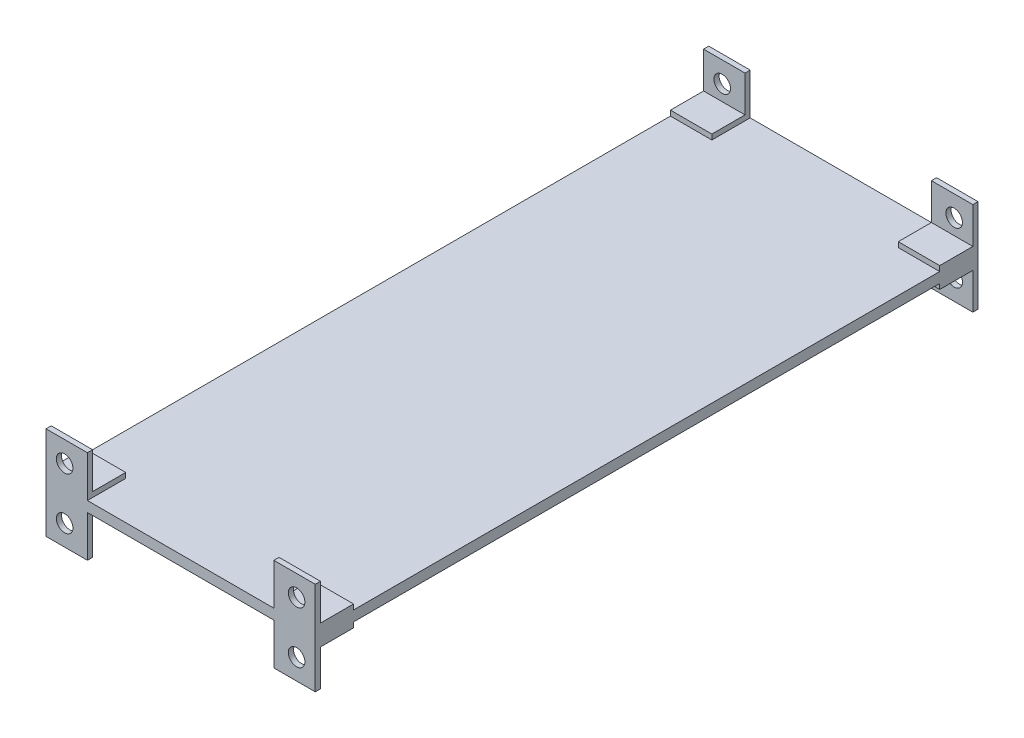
from build123d import *

# Parameters (mm, degrees)
EXTRUDE1_DEPTH      = 0.79375
EXTRUDE1_DEPTH_BACK = 0.79375
SKETCH4_W           = 41.275
SKETCH4_H           = 101.6
EXTRUDE2_DEPTH      = 6.35
EXTRUDE2_DEPTH_BACK = 7.9375
SKETCH5_W           = 6.35
SKETCH5_H           = 0.79375
EXTRUDE3_DEPTH      = 0.79375
EXTRUDE3_DEPTH_BACK = 2.38125
SKETCH6_W           = 6.35
SKETCH6_H           = 5.08
SKETCH7_R           = 1.27
CUT_EXTRUDE1_DEPTH  = 104.920640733


with BuildPart() as part:
    # Sketch4 → Extrude1 (new, two sides: drawn at the far end of the back side and taken through both)
    with BuildSketch(Plane(origin=(0, 0, 0), x_dir=(1, 0, 0), z_dir=(0, 1, 0)).offset(-EXTRUDE1_DEPTH_BACK)):
        with Locations((0, 50.8)):
            Rectangle(SKETCH4_W, SKETCH4_H)
    extrude(amount=EXTRUDE1_DEPTH + EXTRUDE1_DEPTH_BACK)

    # Sketch5 → Extrude2 (add, two sides: drawn at the far end of the back side and taken through both)
    with BuildSketch(Plane(origin=(0, 0.79375, 0), x_dir=(-1, 0, 0), z_dir=(0, 1, 0)).offset(-EXTRUDE2_DEPTH_BACK)):
        with Locations((-17.4625, -0.396875)):
            Rectangle(SKETCH5_W, SKETCH5_H)
        with Locations((17.4625, -0.396875)):
            Rectangle(SKETCH5_W, SKETCH5_H)
        with Locations((17.4625, -101.203125)):
            Rectangle(SKETCH5_W, SKETCH5_H)
        with Locations((-17.4625, -101.203125)):
            Rectangle(SKETCH5_W, SKETCH5_H)
    extrude(amount=EXTRUDE2_DEPTH + EXTRUDE2_DEPTH_BACK)

    # Sketch6 → Extrude3 (add, two sides: drawn at the far end of the back side and taken through both)
    with BuildSketch(Plane(origin=(0, 0.79375, 0), x_dir=(-1, 0, 0), z_dir=(0, 1, 0)).offset(-EXTRUDE3_DEPTH_BACK)):
        with Locations((-17.4625, -3.33375)):
            Rectangle(SKETCH6_W, SKETCH6_H)
        with Locations((17.4625, -3.33375)):
            Rectangle(SKETCH6_W, SKETCH6_H)
        with Locations((17.4625, -98.26625)):
            Rectangle(SKETCH6_W, SKETCH6_H)
        with Locations((-17.4625, -98.26625)):
            Rectangle(SKETCH6_W, SKETCH6_H)
    extrude(amount=EXTRUDE3_DEPTH + EXTRUDE3_DEPTH_BACK)

    # Sketch7 → Cut-Extrude1 (cut, through all)
    with BuildSketch(Plane.XY):
        with Locations((-17.78, 3.96875)):
            Circle(SKETCH7_R)
        with Locations((-17.78, -3.96875)):
            Circle(SKETCH7_R)
        with Locations((17.78, 3.96875)):
            Circle(SKETCH7_R)
        with Locations((17.78, -3.96875)):
            Circle(SKETCH7_R)
    extrude(amount=-CUT_EXTRUDE1_DEPTH, mode=Mode.SUBTRACT)


solid = part.part
